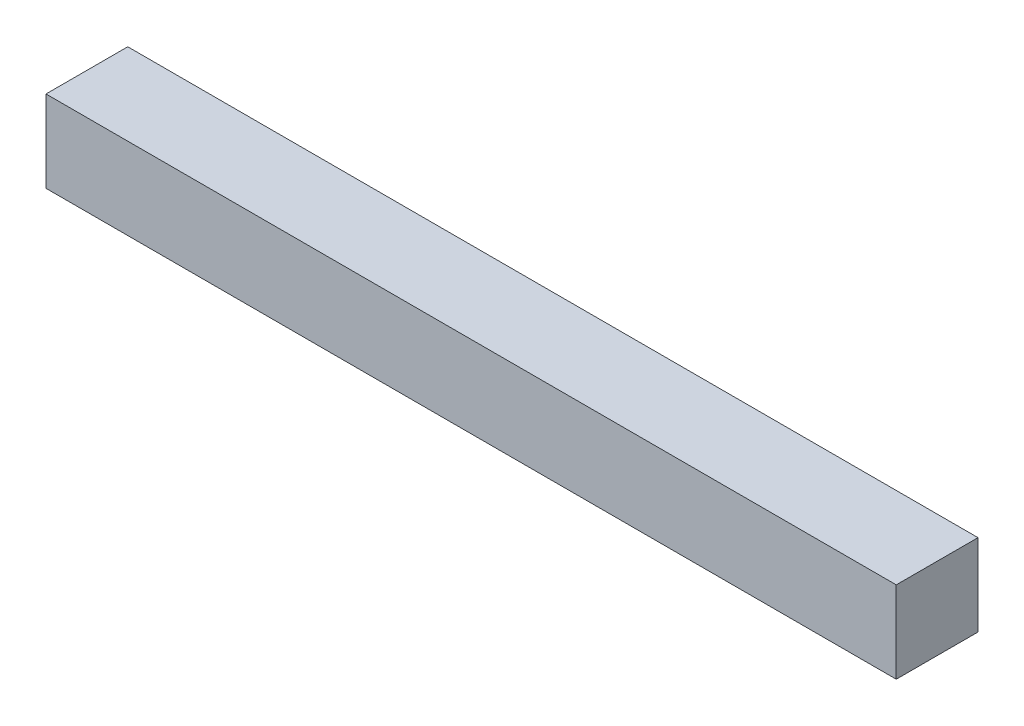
from build123d import *

# Parameters (mm, degrees)
SKETCH1_W           = 33.02
SKETCH1_H           = 3.175
BOSS_EXTRUDE1_DEPTH = 3.175


with BuildPart() as part:
    # Sketch1 → Boss-Extrude1 (new body)
    with BuildSketch(Plane(origin=(0, 0, 0), x_dir=(1, 0, 0), z_dir=(0, 1, 0))):
        with Locations((16.51, 1.5875)):
            Rectangle(SKETCH1_W, SKETCH1_H)
    extrude(amount=BOSS_EXTRUDE1_DEPTH)


solid = part.part
